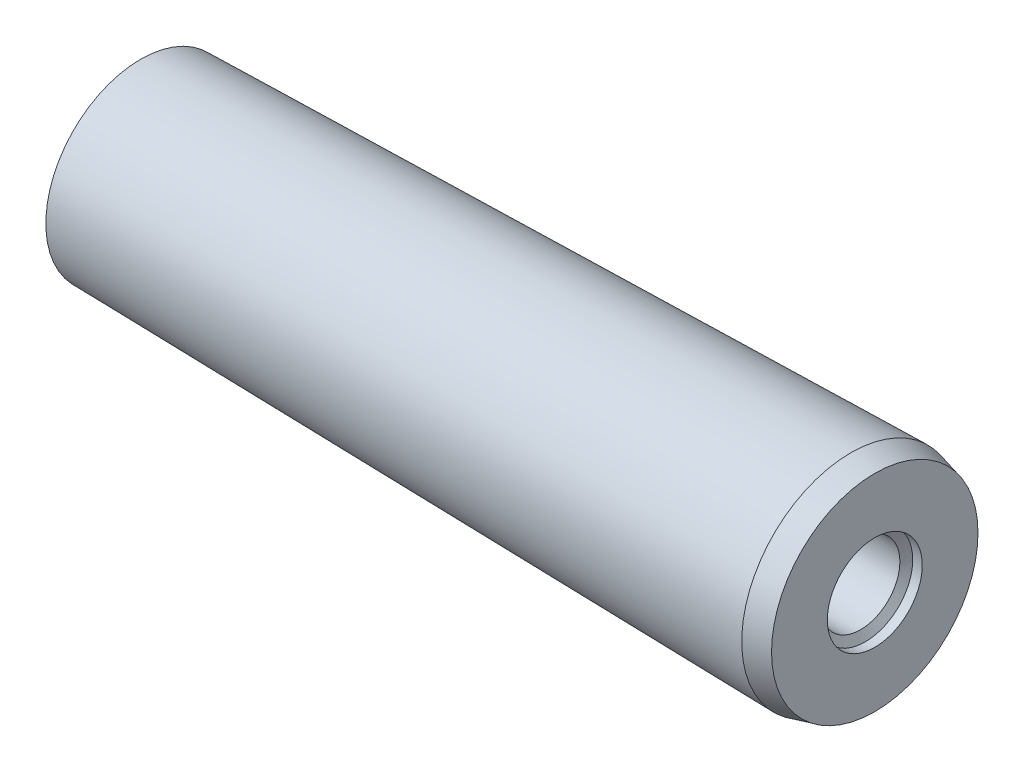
ISO-10303-21;
HEADER;
FILE_DESCRIPTION(('STEP AP214'),'2;1');
FILE_NAME('part.step','',(''),(''),'','','');
FILE_SCHEMA(('AUTOMOTIVE_DESIGN { 1 0 10303 214 1 1 1 1 }'));
ENDSEC;
DATA;
#1=APPLICATION_CONTEXT('core data for automotive mechanical design processes');
#2=APPLICATION_PROTOCOL_DEFINITION('international standard','automotive_design',2000,#1);
#3=PRODUCT_CONTEXT('',#1,'mechanical');
#4=PRODUCT('Part','Part','',(#3));
#5=PRODUCT_RELATED_PRODUCT_CATEGORY('part','',(#4));
#6=PRODUCT_DEFINITION_FORMATION('','',#4);
#7=PRODUCT_DEFINITION_CONTEXT('part definition',#1,'design');
#8=PRODUCT_DEFINITION('design','',#6,#7);
#9=PRODUCT_DEFINITION_SHAPE('','',#8);
#10=(LENGTH_UNIT() NAMED_UNIT(*) SI_UNIT(.MILLI.,.METRE.));
#11=(NAMED_UNIT(*) PLANE_ANGLE_UNIT() SI_UNIT($,.RADIAN.));
#12=(NAMED_UNIT(*) SI_UNIT($,.STERADIAN.) SOLID_ANGLE_UNIT());
#13=UNCERTAINTY_MEASURE_WITH_UNIT(LENGTH_MEASURE(1.E-05),#10,'distance_accuracy_value','');
#14=(GEOMETRIC_REPRESENTATION_CONTEXT(3) GLOBAL_UNCERTAINTY_ASSIGNED_CONTEXT((#13)) GLOBAL_UNIT_ASSIGNED_CONTEXT((#10,
#11,#12)) REPRESENTATION_CONTEXT('',''));
#15=CARTESIAN_POINT('',(0.,0.,0.));
#16=DIRECTION('',(0.,0.,1.));
#17=DIRECTION('',(1.,0.,0.));
#18=AXIS2_PLACEMENT_3D('',#15,#16,#17);
#19=CARTESIAN_POINT('',(-150.,0.,0.));
#20=DIRECTION('',(1.,0.,0.));
#21=DIRECTION('',(0.,1.,0.));
#22=AXIS2_PLACEMENT_3D('',#19,#20,#21);
#23=SPHERICAL_SURFACE('',#22,50.);
#24=CARTESIAN_POINT('',(-193.301270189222,0.,0.));
#25=DIRECTION('',(1.,0.,0.));
#26=DIRECTION('',(0.,1.,0.));
#27=AXIS2_PLACEMENT_3D('',#24,#25,#26);
#28=CIRCLE('',#27,25.);
#29=CARTESIAN_POINT('',(-193.301270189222,25.,0.));
#30=VERTEX_POINT('',#29);
#31=EDGE_CURVE('E80',#30,#30,#28,.T.);
#32=ORIENTED_EDGE('',*,*,#31,.F.);
#33=EDGE_LOOP('',(#32));
#34=FACE_BOUND('',#33,.T.);
#35=ADVANCED_FACE('F35',(#34),#23,.T.);
#36=CARTESIAN_POINT('',(-55.976729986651,0.,0.));
#37=DIRECTION('',(1.,0.,0.));
#38=DIRECTION('',(0.,1.,0.));
#39=AXIS2_PLACEMENT_3D('',#36,#37,#38);
#40=CONICAL_SURFACE('',#39,0.,1.0471975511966);
#41=CARTESIAN_POINT('',(-50.,0.,0.));
#42=DIRECTION('',(1.,0.,0.));
#43=DIRECTION('',(0.,1.,0.));
#44=AXIS2_PLACEMENT_3D('',#41,#42,#43);
#45=CIRCLE('',#44,10.352);
#46=CARTESIAN_POINT('',(-50.,10.352,0.));
#47=VERTEX_POINT('',#46);
#48=EDGE_CURVE('E11',#47,#47,#45,.T.);
#49=ORIENTED_EDGE('',*,*,#48,.T.);
#50=EDGE_LOOP('',(#49));
#51=FACE_BOUND('',#50,.T.);
#52=CARTESIAN_POINT('',(-55.976729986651,0.,0.));
#53=VERTEX_POINT('',#52);
#54=VERTEX_LOOP('',#53);
#55=FACE_BOUND('',#54,.T.);
#56=ADVANCED_FACE('F44',(#51,#55),#40,.F.);
#57=CARTESIAN_POINT('',(0.,0.,0.));
#58=DIRECTION('',(1.,0.,0.));
#59=DIRECTION('',(0.,1.,0.));
#60=AXIS2_PLACEMENT_3D('',#57,#58,#59);
#61=CYLINDRICAL_SURFACE('',#60,10.352);
#62=CARTESIAN_POINT('',(-3.74014837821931,0.,0.));
#63=DIRECTION('',(1.,0.,0.));
#64=DIRECTION('',(0.,1.,0.));
#65=AXIS2_PLACEMENT_3D('',#62,#63,#64);
#66=CIRCLE('',#65,10.352);
#67=CARTESIAN_POINT('',(-3.74014837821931,10.352,0.));
#68=VERTEX_POINT('',#67);
#69=EDGE_CURVE('E41',#68,#68,#66,.T.);
#70=ORIENTED_EDGE('',*,*,#69,.T.);
#71=EDGE_LOOP('',(#70));
#72=FACE_BOUND('',#71,.T.);
#73=ORIENTED_EDGE('',*,*,#48,.F.);
#74=EDGE_LOOP('',(#73));
#75=FACE_BOUND('',#74,.T.);
#76=ADVANCED_FACE('F46',(#72,#75),#61,.F.);
#77=CARTESIAN_POINT('',(-3.74014837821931,0.,0.));
#78=DIRECTION('',(1.,0.,0.));
#79=DIRECTION('',(0.,1.,0.));
#80=AXIS2_PLACEMENT_3D('',#77,#78,#79);
#81=CONICAL_SURFACE('',#80,10.352,1.0471975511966);
#82=CARTESIAN_POINT('',(-2.5,0.,0.));
#83=DIRECTION('',(1.,0.,0.));
#84=DIRECTION('',(0.,1.,0.));
#85=AXIS2_PLACEMENT_3D('',#82,#83,#84);
#86=CIRCLE('',#85,12.5);
#87=CARTESIAN_POINT('',(-2.5,12.5,0.));
#88=VERTEX_POINT('',#87);
#89=EDGE_CURVE('E93',#88,#88,#86,.T.);
#90=ORIENTED_EDGE('',*,*,#89,.T.);
#91=EDGE_LOOP('',(#90));
#92=FACE_BOUND('',#91,.T.);
#93=ORIENTED_EDGE('',*,*,#69,.F.);
#94=EDGE_LOOP('',(#93));
#95=FACE_BOUND('',#94,.T.);
#96=ADVANCED_FACE('F52',(#92,#95),#81,.F.);
#97=CARTESIAN_POINT('',(0.,0.,0.));
#98=DIRECTION('',(1.,0.,0.));
#99=DIRECTION('',(0.,1.,0.));
#100=AXIS2_PLACEMENT_3D('',#97,#98,#99);
#101=CYLINDRICAL_SURFACE('',#100,12.5);
#102=CARTESIAN_POINT('',(0.,0.,0.));
#103=DIRECTION('',(1.,0.,0.));
#104=DIRECTION('',(0.,1.,0.));
#105=AXIS2_PLACEMENT_3D('',#102,#103,#104);
#106=CIRCLE('',#105,12.5);
#107=CARTESIAN_POINT('',(0.,12.5,0.));
#108=VERTEX_POINT('',#107);
#109=EDGE_CURVE('E87',#108,#108,#106,.T.);
#110=ORIENTED_EDGE('',*,*,#109,.T.);
#111=EDGE_LOOP('',(#110));
#112=FACE_BOUND('',#111,.T.);
#113=ORIENTED_EDGE('',*,*,#89,.F.);
#114=EDGE_LOOP('',(#113));
#115=FACE_BOUND('',#114,.T.);
#116=ADVANCED_FACE('F59',(#112,#115),#101,.F.);
#117=CARTESIAN_POINT('',(0.,12.5,0.));
#118=DIRECTION('',(1.,0.,0.));
#119=DIRECTION('',(0.,1.,0.));
#120=AXIS2_PLACEMENT_3D('',#117,#118,#119);
#121=PLANE('',#120);
#122=CARTESIAN_POINT('',(0.,0.,0.));
#123=DIRECTION('',(1.,0.,0.));
#124=DIRECTION('',(0.,1.,0.));
#125=AXIS2_PLACEMENT_3D('',#122,#123,#124);
#126=CIRCLE('',#125,27.1862720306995);
#127=CARTESIAN_POINT('',(0.,27.1862720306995,0.));
#128=VERTEX_POINT('',#127);
#129=EDGE_CURVE('E84',#128,#128,#126,.T.);
#130=ORIENTED_EDGE('',*,*,#129,.T.);
#131=EDGE_LOOP('',(#130));
#132=FACE_BOUND('',#131,.T.);
#133=ORIENTED_EDGE('',*,*,#109,.F.);
#134=EDGE_LOOP('',(#133));
#135=FACE_BOUND('',#134,.T.);
#136=ADVANCED_FACE('F63',(#132,#135),#121,.T.);
#137=CARTESIAN_POINT('',(0.,0.,0.));
#138=DIRECTION('',(-1.,0.,0.));
#139=DIRECTION('',(0.,-1.,0.));
#140=AXIS2_PLACEMENT_3D('',#137,#138,#139);
#141=CONICAL_SURFACE('',#140,27.1862720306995,0.241802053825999);
#142=CARTESIAN_POINT('',(-6.3,0.,0.));
#143=DIRECTION('',(1.,0.,0.));
#144=DIRECTION('',(0.,1.,0.));
#145=AXIS2_PLACEMENT_3D('',#142,#143,#144);
#146=CIRCLE('',#145,28.7400254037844);
#147=CARTESIAN_POINT('',(-6.3,28.7400254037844,0.));
#148=VERTEX_POINT('',#147);
#149=EDGE_CURVE('E83',#148,#148,#146,.T.);
#150=ORIENTED_EDGE('',*,*,#149,.T.);
#151=EDGE_LOOP('',(#150));
#152=FACE_BOUND('',#151,.T.);
#153=ORIENTED_EDGE('',*,*,#129,.F.);
#154=EDGE_LOOP('',(#153));
#155=FACE_BOUND('',#154,.T.);
#156=ADVANCED_FACE('F67',(#152,#155),#141,.T.);
#157=CARTESIAN_POINT('',(-6.3,0.,0.));
#158=DIRECTION('',(1.,0.,0.));
#159=DIRECTION('',(0.,1.,0.));
#160=AXIS2_PLACEMENT_3D('',#157,#158,#159);
#161=CONICAL_SURFACE('',#160,28.7400254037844,0.0199973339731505);
#162=ORIENTED_EDGE('',*,*,#31,.T.);
#163=EDGE_LOOP('',(#162));
#164=FACE_BOUND('',#163,.T.);
#165=ORIENTED_EDGE('',*,*,#149,.F.);
#166=EDGE_LOOP('',(#165));
#167=FACE_BOUND('',#166,.T.);
#168=ADVANCED_FACE('F71',(#164,#167),#161,.T.);
#169=CLOSED_SHELL('',(#35,#56,#76,#96,#116,#136,#156,#168));
#170=MANIFOLD_SOLID_BREP('B2',#169);
#171=ADVANCED_BREP_SHAPE_REPRESENTATION('',(#18,#170),#14);
#172=SHAPE_DEFINITION_REPRESENTATION(#9,#171);
ENDSEC;
END-ISO-10303-21;
